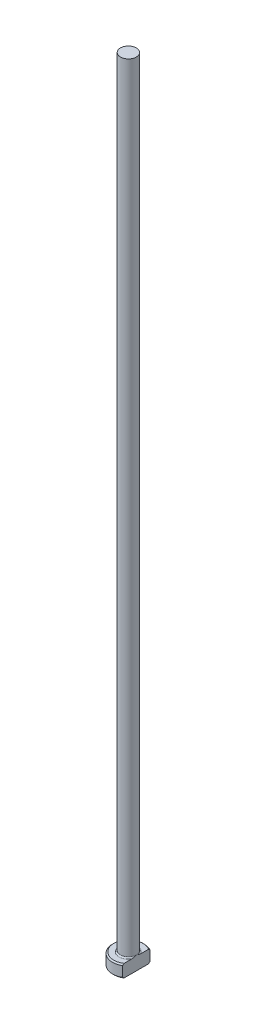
ISO-10303-21;
HEADER;
FILE_DESCRIPTION(('STEP AP214'),'2;1');
FILE_NAME('part.step','',(''),(''),'','','');
FILE_SCHEMA(('AUTOMOTIVE_DESIGN { 1 0 10303 214 1 1 1 1 }'));
ENDSEC;
DATA;
#1=APPLICATION_CONTEXT('core data for automotive mechanical design processes');
#2=APPLICATION_PROTOCOL_DEFINITION('international standard','automotive_design',2000,#1);
#3=PRODUCT_CONTEXT('',#1,'mechanical');
#4=PRODUCT('Part','Part','',(#3));
#5=PRODUCT_RELATED_PRODUCT_CATEGORY('part','',(#4));
#6=PRODUCT_DEFINITION_FORMATION('','',#4);
#7=PRODUCT_DEFINITION_CONTEXT('part definition',#1,'design');
#8=PRODUCT_DEFINITION('design','',#6,#7);
#9=PRODUCT_DEFINITION_SHAPE('','',#8);
#10=(LENGTH_UNIT() NAMED_UNIT(*) SI_UNIT(.MILLI.,.METRE.));
#11=(NAMED_UNIT(*) PLANE_ANGLE_UNIT() SI_UNIT($,.RADIAN.));
#12=(NAMED_UNIT(*) SI_UNIT($,.STERADIAN.) SOLID_ANGLE_UNIT());
#13=UNCERTAINTY_MEASURE_WITH_UNIT(LENGTH_MEASURE(1.E-05),#10,'distance_accuracy_value','');
#14=(GEOMETRIC_REPRESENTATION_CONTEXT(3) GLOBAL_UNCERTAINTY_ASSIGNED_CONTEXT((#13)) GLOBAL_UNIT_ASSIGNED_CONTEXT((#10,
#11,#12)) REPRESENTATION_CONTEXT('',''));
#15=CARTESIAN_POINT('',(0.,0.,0.));
#16=DIRECTION('',(0.,0.,1.));
#17=DIRECTION('',(1.,0.,0.));
#18=AXIS2_PLACEMENT_3D('',#15,#16,#17);
#19=CARTESIAN_POINT('',(0.,0.,0.));
#20=DIRECTION('',(0.,-1.,0.));
#21=DIRECTION('',(0.,0.,-1.));
#22=AXIS2_PLACEMENT_3D('',#19,#20,#21);
#23=PLANE('',#22);
#24=CARTESIAN_POINT('',(0.,0.,0.));
#25=DIRECTION('',(0.,-1.,0.));
#26=DIRECTION('',(0.,0.,-1.));
#27=AXIS2_PLACEMENT_3D('',#24,#25,#26);
#28=CIRCLE('',#27,2.29999999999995);
#29=CARTESIAN_POINT('',(1.24999999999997,0.,1.93067345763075));
#30=VERTEX_POINT('',#29);
#31=CARTESIAN_POINT('',(1.24999999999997,0.,-1.93067345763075));
#32=VERTEX_POINT('',#31);
#33=EDGE_CURVE('E98',#30,#32,#28,.T.);
#34=ORIENTED_EDGE('',*,*,#33,.T.);
#35=DIRECTION('',(0.,0.,1.));
#36=VECTOR('',#35,1.);
#37=CARTESIAN_POINT('',(1.24999999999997,0.,-2.16506350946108));
#38=LINE('',#37,#36);
#39=EDGE_CURVE('E83',#32,#30,#38,.T.);
#40=ORIENTED_EDGE('',*,*,#39,.T.);
#41=EDGE_LOOP('',(#34,#40));
#42=FACE_BOUND('',#41,.T.);
#43=ADVANCED_FACE('F32',(#42),#23,.T.);
#44=CARTESIAN_POINT('',(0.,259.958771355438,0.));
#45=DIRECTION('',(0.,1.,0.));
#46=DIRECTION('',(0.,0.,1.));
#47=AXIS2_PLACEMENT_3D('',#44,#45,#46);
#48=CYLINDRICAL_SURFACE('',#47,2.49999999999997);
#49=CARTESIAN_POINT('',(0.,1.79999999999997,0.));
#50=DIRECTION('',(0.,1.,0.));
#51=DIRECTION('',(0.,0.,1.));
#52=AXIS2_PLACEMENT_3D('',#49,#50,#51);
#53=CIRCLE('',#52,2.49999999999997);
#54=CARTESIAN_POINT('',(1.24999999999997,1.79999999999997,2.16506350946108));
#55=VERTEX_POINT('',#54);
#56=CARTESIAN_POINT('',(1.24999999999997,1.79999999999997,-2.16506350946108));
#57=VERTEX_POINT('',#56);
#58=EDGE_CURVE('E104',#55,#57,#53,.F.);
#59=ORIENTED_EDGE('',*,*,#58,.T.);
#60=DIRECTION('',(0.,-1.,0.));
#61=VECTOR('',#60,1.);
#62=CARTESIAN_POINT('',(1.24999999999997,125.,-2.16506350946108));
#63=LINE('',#62,#61);
#64=CARTESIAN_POINT('',(1.24999999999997,0.200000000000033,-2.16506350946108));
#65=VERTEX_POINT('',#64);
#66=EDGE_CURVE('E183',#57,#65,#63,.T.);
#67=ORIENTED_EDGE('',*,*,#66,.T.);
#68=CARTESIAN_POINT('',(0.,0.200000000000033,0.));
#69=DIRECTION('',(0.,-1.,0.));
#70=DIRECTION('',(0.,0.,-1.));
#71=AXIS2_PLACEMENT_3D('',#68,#69,#70);
#72=CIRCLE('',#71,2.49999999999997);
#73=CARTESIAN_POINT('',(1.24999999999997,0.200000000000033,2.16506350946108));
#74=VERTEX_POINT('',#73);
#75=EDGE_CURVE('E100',#65,#74,#72,.F.);
#76=ORIENTED_EDGE('',*,*,#75,.T.);
#77=DIRECTION('',(0.,-1.,0.));
#78=VECTOR('',#77,1.);
#79=CARTESIAN_POINT('',(1.24999999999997,125.,2.16506350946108));
#80=LINE('',#79,#78);
#81=EDGE_CURVE('E93',#55,#74,#80,.T.);
#82=ORIENTED_EDGE('',*,*,#81,.F.);
#83=EDGE_LOOP('',(#59,#67,#76,#82));
#84=FACE_BOUND('',#83,.T.);
#85=ADVANCED_FACE('F158',(#84),#48,.T.);
#86=CARTESIAN_POINT('',(-2.49999999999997,2.,0.));
#87=DIRECTION('',(0.,1.,0.));
#88=DIRECTION('',(0.,0.,1.));
#89=AXIS2_PLACEMENT_3D('',#86,#87,#88);
#90=PLANE('',#89);
#91=CARTESIAN_POINT('',(0.,2.,0.));
#92=DIRECTION('',(0.,1.,0.));
#93=DIRECTION('',(0.,0.,1.));
#94=AXIS2_PLACEMENT_3D('',#91,#92,#93);
#95=CIRCLE('',#94,2.29999999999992);
#96=CARTESIAN_POINT('',(1.24999999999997,2.,-1.9306734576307));
#97=VERTEX_POINT('',#96);
#98=CARTESIAN_POINT('',(1.24999999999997,2.,1.9306734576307));
#99=VERTEX_POINT('',#98);
#100=EDGE_CURVE('E178',#97,#99,#95,.T.);
#101=ORIENTED_EDGE('',*,*,#100,.T.);
#102=DIRECTION('',(0.,0.,-1.));
#103=VECTOR('',#102,1.);
#104=CARTESIAN_POINT('',(1.24999999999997,2.,0.));
#105=LINE('',#104,#103);
#106=CARTESIAN_POINT('',(1.24999999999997,1.99999999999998,0.73484692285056));
#107=VERTEX_POINT('',#106);
#108=EDGE_CURVE('E57',#99,#107,#105,.T.);
#109=ORIENTED_EDGE('',*,*,#108,.T.);
#110=CARTESIAN_POINT('',(0.,2.,0.));
#111=DIRECTION('',(0.,1.,0.));
#112=DIRECTION('',(0.,0.,1.));
#113=AXIS2_PLACEMENT_3D('',#110,#111,#112);
#114=CIRCLE('',#113,1.44999999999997);
#115=CARTESIAN_POINT('',(1.24999999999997,1.99999999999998,-0.734846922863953));
#116=VERTEX_POINT('',#115);
#117=EDGE_CURVE('E107',#107,#116,#114,.F.);
#118=ORIENTED_EDGE('',*,*,#117,.T.);
#119=EDGE_CURVE('E136',#116,#97,#105,.T.);
#120=ORIENTED_EDGE('',*,*,#119,.T.);
#121=EDGE_LOOP('',(#101,#109,#118,#120));
#122=FACE_BOUND('',#121,.T.);
#123=ADVANCED_FACE('F147',(#122),#90,.T.);
#124=CARTESIAN_POINT('',(0.,2.,0.));
#125=DIRECTION('',(0.,-1.,0.));
#126=DIRECTION('',(0.,0.,-1.));
#127=AXIS2_PLACEMENT_3D('',#124,#125,#126);
#128=CONICAL_SURFACE('',#127,2.29999999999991,0.785398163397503);
#129=ORIENTED_EDGE('',*,*,#58,.F.);
#130=CARTESIAN_POINT('',(1.24999999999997,-0.627301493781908,4.76610952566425));
#131=CARTESIAN_POINT('',(1.24999999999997,-0.522786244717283,4.65805337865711));
#132=CARTESIAN_POINT('',(1.24999999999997,-0.418383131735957,4.54988840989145));
#133=CARTESIAN_POINT('',(1.24999999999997,-0.209867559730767,4.33327605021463));
#134=CARTESIAN_POINT('',(1.24999999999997,-0.105755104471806,4.22482865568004));
#135=CARTESIAN_POINT('',(1.24999999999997,0.102163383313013,4.0075337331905));
#136=CARTESIAN_POINT('',(1.24999999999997,0.205969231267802,3.89868602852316));
#137=CARTESIAN_POINT('',(1.24999999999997,0.413121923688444,3.68055575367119));
#138=CARTESIAN_POINT('',(1.24999999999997,0.516468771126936,3.57127318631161));
#139=CARTESIAN_POINT('',(1.24999999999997,0.720522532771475,3.35432408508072));
#140=CARTESIAN_POINT('',(1.24999999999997,0.821241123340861,3.24666854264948));
#141=CARTESIAN_POINT('',(1.24999999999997,1.02192410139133,3.03065701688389));
#142=CARTESIAN_POINT('',(1.24999999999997,1.12188849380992,2.92230103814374));
#143=CARTESIAN_POINT('',(1.24999999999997,1.32077037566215,2.70467415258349));
#144=CARTESIAN_POINT('',(1.24999999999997,1.41968808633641,2.59540344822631));
#145=CARTESIAN_POINT('',(1.24999999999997,1.61608273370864,2.37557697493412));
#146=CARTESIAN_POINT('',(1.24999999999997,1.71355972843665,2.26502125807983));
#147=CARTESIAN_POINT('',(1.24999999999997,1.86911393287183,2.08515617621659));
#148=CARTESIAN_POINT('',(1.24999999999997,1.92785594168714,2.01642247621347));
#149=CARTESIAN_POINT('',(1.24999999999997,2.04429378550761,1.87806056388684));
#150=CARTESIAN_POINT('',(1.24999999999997,2.10198951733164,1.80843226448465));
#151=CARTESIAN_POINT('',(1.24999999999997,2.21658041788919,1.66728976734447));
#152=CARTESIAN_POINT('',(1.24999999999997,2.27346067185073,1.59576341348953));
#153=CARTESIAN_POINT('',(1.24999999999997,2.38522965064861,1.45118948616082));
#154=CARTESIAN_POINT('',(1.24999999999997,2.44011885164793,1.37814228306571));
#155=CARTESIAN_POINT('',(1.24999999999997,2.547887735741,1.22886697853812));
#156=CARTESIAN_POINT('',(1.24999999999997,2.60072420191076,1.1526074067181));
#157=CARTESIAN_POINT('',(1.24999999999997,2.70212030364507,0.997098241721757));
#158=CARTESIAN_POINT('',(1.24999999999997,2.75067405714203,0.917844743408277));
#159=CARTESIAN_POINT('',(1.24999999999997,2.84043729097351,0.756494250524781));
#160=CARTESIAN_POINT('',(1.24999999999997,2.88173033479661,0.674444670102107));
#161=CARTESIAN_POINT('',(1.24999999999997,2.95366083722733,0.50583597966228));
#162=CARTESIAN_POINT('',(1.24999999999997,2.98433405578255,0.419293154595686));
#163=CARTESIAN_POINT('',(1.24999999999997,3.01753107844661,0.28950787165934));
#164=CARTESIAN_POINT('',(1.24999999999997,3.0263353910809,0.247870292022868));
#165=CARTESIAN_POINT('',(1.24999999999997,3.03997448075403,0.163937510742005));
#166=CARTESIAN_POINT('',(1.24999999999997,3.04480960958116,0.121642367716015));
#167=CARTESIAN_POINT('',(1.24999999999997,3.05016786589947,0.0369068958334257));
#168=CARTESIAN_POINT('',(1.24999999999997,3.05070431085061,-0.00553257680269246));
#169=CARTESIAN_POINT('',(1.24999999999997,3.04746162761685,-0.0902467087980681));
#170=CARTESIAN_POINT('',(1.24999999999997,3.04368214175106,-0.132521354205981));
#171=CARTESIAN_POINT('',(1.24999999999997,3.03212264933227,-0.216135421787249));
#172=CARTESIAN_POINT('',(1.24999999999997,3.02437758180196,-0.257479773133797));
#173=CARTESIAN_POINT('',(1.24999999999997,3.00536735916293,-0.339354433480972));
#174=CARTESIAN_POINT('',(1.24999999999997,2.99410082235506,-0.379884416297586));
#175=CARTESIAN_POINT('',(1.24999999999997,2.96852211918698,-0.460209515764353));
#176=CARTESIAN_POINT('',(1.24999999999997,2.95419322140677,-0.499999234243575));
#177=CARTESIAN_POINT('',(1.24999999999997,2.92306392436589,-0.578577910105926));
#178=CARTESIAN_POINT('',(1.24999999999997,2.90626403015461,-0.617367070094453));
#179=CARTESIAN_POINT('',(1.24999999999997,2.85269034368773,-0.73271994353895));
#180=CARTESIAN_POINT('',(1.24999999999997,2.81287978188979,-0.807869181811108));
#181=CARTESIAN_POINT('',(1.24999999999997,2.72799210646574,-0.955157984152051));
#182=CARTESIAN_POINT('',(1.24999999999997,2.68290855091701,-1.02729371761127));
#183=CARTESIAN_POINT('',(1.24999999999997,2.58903993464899,-1.16950551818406));
#184=CARTESIAN_POINT('',(1.24999999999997,2.54024093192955,-1.2395723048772));
#185=CARTESIAN_POINT('',(1.24999999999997,2.44021824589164,-1.37788366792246));
#186=CARTESIAN_POINT('',(1.24999999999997,2.38899576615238,-1.44612912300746));
#187=CARTESIAN_POINT('',(1.24999999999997,2.28411092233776,-1.58215279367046));
#188=CARTESIAN_POINT('',(1.24999999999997,2.2304252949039,-1.64991298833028));
#189=CARTESIAN_POINT('',(1.24999999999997,2.12172412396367,-1.78436052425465));
#190=CARTESIAN_POINT('',(1.24999999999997,2.06670849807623,-1.85104779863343));
#191=CARTESIAN_POINT('',(1.24999999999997,1.90044437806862,-2.04954410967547));
#192=CARTESIAN_POINT('',(1.24999999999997,1.78772044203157,-2.18011527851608));
#193=CARTESIAN_POINT('',(1.24999999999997,1.57927088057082,-2.41711311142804));
#194=CARTESIAN_POINT('',(1.24999999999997,1.48391557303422,-2.52386864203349));
#195=CARTESIAN_POINT('',(1.24999999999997,1.29202937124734,-2.73632311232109));
#196=CARTESIAN_POINT('',(1.24999999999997,1.19549844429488,-2.84202202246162));
#197=CARTESIAN_POINT('',(1.24999999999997,0.904469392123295,-3.15815976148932));
#198=CARTESIAN_POINT('',(1.24999999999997,0.708713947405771,-3.36743889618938));
#199=CARTESIAN_POINT('',(1.24999999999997,0.323382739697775,-3.77561196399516));
#200=CARTESIAN_POINT('',(1.24999999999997,0.133884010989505,-3.97457897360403));
#201=CARTESIAN_POINT('',(1.24999999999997,-0.151120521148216,-4.27209258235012));
#202=CARTESIAN_POINT('',(1.24999999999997,-0.246194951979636,-4.37105278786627));
#203=CARTESIAN_POINT('',(1.24999999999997,-0.436581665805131,-4.56874260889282));
#204=CARTESIAN_POINT('',(1.24999999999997,-0.531893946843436,-4.66747222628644));
#205=CARTESIAN_POINT('',(1.24999999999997,-0.627301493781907,-4.76610952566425));
#206=B_SPLINE_CURVE_WITH_KNOTS('',3,(#130,#131,#132,#133,#134,#135,#136,#137,#138,#139,#140,
#141,#142,#143,#144,#145,#146,#147,#148,#149,#150,#151,#152,#153,#154,#155,#156,#157,#158,#159,
#160,#161,#162,#163,#164,#165,#166,#167,#168,#169,#170,#171,#172,#173,#174,#175,#176,#177,#178,
#179,#180,#181,#182,#183,#184,#185,#186,#187,#188,#189,#190,#191,#192,#193,#194,#195,#196,#197,
#198,#199,#200,#201,#202,#203,#204,#205),.UNSPECIFIED.,.F.,.F.,(4,2,2,2,2,2,2,2,2,2,2,2,2,2,2,2,
2,2,2,2,2,2,2,2,2,2,2,2,2,2,2,2,2,2,2,2,2,4),(0.,0.450994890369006,0.901995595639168,
1.35322763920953,1.80445675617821,2.24672733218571,2.68899501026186,3.13116725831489,
3.5733216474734,3.84456018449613,4.11582532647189,4.38995864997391,4.66402597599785,
4.94225842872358,5.22086725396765,5.49602313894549,5.77024327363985,5.8977564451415,
6.0252583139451,6.15236502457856,6.2794822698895,6.40549833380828,6.5315639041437,
6.65833670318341,6.78508362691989,7.03983854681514,7.29490801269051,7.55098686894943,
7.80693985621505,8.06626716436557,8.32561057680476,8.84304654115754,9.2724624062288,
9.70189024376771,10.5615524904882,11.3858525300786,11.797544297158,12.2092326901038),.UNSPECIFIED.);
#207=EDGE_CURVE('E135',#55,#99,#206,.T.);
#208=ORIENTED_EDGE('',*,*,#207,.T.);
#209=ORIENTED_EDGE('',*,*,#100,.F.);
#210=EDGE_CURVE('E127',#97,#57,#206,.T.);
#211=ORIENTED_EDGE('',*,*,#210,.T.);
#212=EDGE_LOOP('',(#129,#208,#209,#211));
#213=FACE_BOUND('',#212,.T.);
#214=ADVANCED_FACE('F143',(#213),#128,.T.);
#215=CARTESIAN_POINT('',(0.,0.200000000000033,0.));
#216=DIRECTION('',(0.,1.,0.));
#217=DIRECTION('',(0.,0.,1.));
#218=AXIS2_PLACEMENT_3D('',#215,#216,#217);
#219=CONICAL_SURFACE('',#218,2.49999999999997,0.785398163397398);
#220=ORIENTED_EDGE('',*,*,#75,.F.);
#221=CARTESIAN_POINT('',(1.24999999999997,2.62730149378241,-4.76610952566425));
#222=CARTESIAN_POINT('',(1.24999999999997,2.52278624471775,-4.6580533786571));
#223=CARTESIAN_POINT('',(1.24999999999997,2.41838313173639,-4.54988840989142));
#224=CARTESIAN_POINT('',(1.24999999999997,2.20986755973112,-4.33327605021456));
#225=CARTESIAN_POINT('',(1.24999999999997,2.10575510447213,-4.22482865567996));
#226=CARTESIAN_POINT('',(1.24999999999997,1.89783661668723,-4.00753373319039));
#227=CARTESIAN_POINT('',(1.24999999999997,1.79403076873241,-3.89868602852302));
#228=CARTESIAN_POINT('',(1.24999999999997,1.58687807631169,-3.68055575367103));
#229=CARTESIAN_POINT('',(1.24999999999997,1.48353122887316,-3.57127318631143));
#230=CARTESIAN_POINT('',(1.24999999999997,1.27947746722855,-3.35432408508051));
#231=CARTESIAN_POINT('',(1.24999999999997,1.17875887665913,-3.24666854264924));
#232=CARTESIAN_POINT('',(1.24999999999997,0.978075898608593,-3.03065701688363));
#233=CARTESIAN_POINT('',(1.24999999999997,0.878111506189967,-2.92230103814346));
#234=CARTESIAN_POINT('',(1.24999999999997,0.679229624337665,-2.70467415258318));
#235=CARTESIAN_POINT('',(1.24999999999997,0.580311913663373,-2.59540344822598));
#236=CARTESIAN_POINT('',(1.24999999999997,0.383917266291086,-2.37557697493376));
#237=CARTESIAN_POINT('',(1.24999999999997,0.286440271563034,-2.26502125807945));
#238=CARTESIAN_POINT('',(1.24999999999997,0.130886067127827,-2.08515617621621));
#239=CARTESIAN_POINT('',(1.24999999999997,0.0721440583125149,-2.0164224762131));
#240=CARTESIAN_POINT('',(1.24999999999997,-0.0442937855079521,-1.87806056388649));
#241=CARTESIAN_POINT('',(1.24999999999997,-0.101989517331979,-1.80843226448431));
#242=CARTESIAN_POINT('',(1.24999999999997,-0.216580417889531,-1.66728976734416));
#243=CARTESIAN_POINT('',(1.24999999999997,-0.273460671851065,-1.59576341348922));
#244=CARTESIAN_POINT('',(1.24999999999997,-0.385229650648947,-1.45118948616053));
#245=CARTESIAN_POINT('',(1.24999999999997,-0.440118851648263,-1.37814228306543));
#246=CARTESIAN_POINT('',(1.24999999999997,-0.547887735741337,-1.22886697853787));
#247=CARTESIAN_POINT('',(1.24999999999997,-0.600724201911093,-1.15260740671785));
#248=CARTESIAN_POINT('',(1.24999999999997,-0.702120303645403,-0.997098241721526));
#249=CARTESIAN_POINT('',(1.24999999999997,-0.75067405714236,-0.917844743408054));
#250=CARTESIAN_POINT('',(1.24999999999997,-0.840437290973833,-0.756494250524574));
#251=CARTESIAN_POINT('',(1.24999999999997,-0.881730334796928,-0.674444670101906));
#252=CARTESIAN_POINT('',(1.24999999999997,-0.953660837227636,-0.505835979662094));
#253=CARTESIAN_POINT('',(1.24999999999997,-0.984334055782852,-0.419293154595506));
#254=CARTESIAN_POINT('',(1.24999999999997,-1.0175310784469,-0.289507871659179));
#255=CARTESIAN_POINT('',(1.24999999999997,-1.02633539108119,-0.247870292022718));
#256=CARTESIAN_POINT('',(1.24999999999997,-1.0399744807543,-0.163937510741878));
#257=CARTESIAN_POINT('',(1.24999999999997,-1.04480960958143,-0.121642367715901));
#258=CARTESIAN_POINT('',(1.24999999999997,-1.05016786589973,-0.0369068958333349));
#259=CARTESIAN_POINT('',(1.24999999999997,-1.05070431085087,0.00553257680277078));
#260=CARTESIAN_POINT('',(1.24999999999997,-1.0474616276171,0.0902467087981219));
#261=CARTESIAN_POINT('',(1.24999999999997,-1.04368214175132,0.132521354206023));
#262=CARTESIAN_POINT('',(1.24999999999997,-1.03212264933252,0.216135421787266));
#263=CARTESIAN_POINT('',(1.24999999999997,-1.02437758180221,0.257479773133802));
#264=CARTESIAN_POINT('',(1.24999999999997,-1.00536735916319,0.339354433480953));
#265=CARTESIAN_POINT('',(1.24999999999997,-0.994100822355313,0.379884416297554));
#266=CARTESIAN_POINT('',(1.24999999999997,-0.96852211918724,0.460209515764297));
#267=CARTESIAN_POINT('',(1.24999999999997,-0.954193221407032,0.499999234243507));
#268=CARTESIAN_POINT('',(1.24999999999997,-0.923063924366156,0.578577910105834));
#269=CARTESIAN_POINT('',(1.24999999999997,-0.906264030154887,0.61736707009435));
#270=CARTESIAN_POINT('',(1.24999999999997,-0.852690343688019,0.732719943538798));
#271=CARTESIAN_POINT('',(1.24999999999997,-0.8128797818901,0.807869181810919));
#272=CARTESIAN_POINT('',(1.24999999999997,-0.727992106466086,0.955157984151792));
#273=CARTESIAN_POINT('',(1.24999999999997,-0.682908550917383,1.02729371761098));
#274=CARTESIAN_POINT('',(1.24999999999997,-0.5890399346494,1.1695055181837));
#275=CARTESIAN_POINT('',(1.24999999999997,-0.540240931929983,1.2395723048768));
#276=CARTESIAN_POINT('',(1.24999999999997,-0.440218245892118,1.37788366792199));
#277=CARTESIAN_POINT('',(1.24999999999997,-0.388995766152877,1.44612912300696));
#278=CARTESIAN_POINT('',(1.24999999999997,-0.284110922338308,1.5821527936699));
#279=CARTESIAN_POINT('',(1.24999999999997,-0.230425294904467,1.64991298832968));
#280=CARTESIAN_POINT('',(1.24999999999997,-0.121724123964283,1.78436052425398));
#281=CARTESIAN_POINT('',(1.24999999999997,-0.0667084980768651,1.85104779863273));
#282=CARTESIAN_POINT('',(1.24999999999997,0.0995556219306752,2.04954410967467));
#283=CARTESIAN_POINT('',(1.24999999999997,0.212279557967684,2.18011527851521));
#284=CARTESIAN_POINT('',(1.24999999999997,0.420729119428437,2.41711311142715));
#285=CARTESIAN_POINT('',(1.24999999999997,0.516084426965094,2.52386864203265));
#286=CARTESIAN_POINT('',(1.24999999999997,0.707970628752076,2.73632311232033));
#287=CARTESIAN_POINT('',(1.24999999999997,0.804501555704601,2.84202202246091));
#288=CARTESIAN_POINT('',(1.24999999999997,1.09553060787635,3.15815976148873));
#289=CARTESIAN_POINT('',(1.24999999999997,1.29128605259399,3.36743889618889));
#290=CARTESIAN_POINT('',(1.24999999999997,1.67661726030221,3.77561196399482));
#291=CARTESIAN_POINT('',(1.24999999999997,1.86611598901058,3.97457897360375));
#292=CARTESIAN_POINT('',(1.24999999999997,2.15112052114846,4.27209258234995));
#293=CARTESIAN_POINT('',(1.24999999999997,2.24619495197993,4.37105278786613));
#294=CARTESIAN_POINT('',(1.24999999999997,2.43658166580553,4.56874260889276));
#295=CARTESIAN_POINT('',(1.24999999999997,2.53189394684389,4.66747222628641));
#296=CARTESIAN_POINT('',(1.24999999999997,2.62730149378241,4.76610952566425));
#297=B_SPLINE_CURVE_WITH_KNOTS('',3,(#221,#222,#223,#224,#225,#226,#227,#228,#229,#230,#231,
#232,#233,#234,#235,#236,#237,#238,#239,#240,#241,#242,#243,#244,#245,#246,#247,#248,#249,#250,
#251,#252,#253,#254,#255,#256,#257,#258,#259,#260,#261,#262,#263,#264,#265,#266,#267,#268,#269,
#270,#271,#272,#273,#274,#275,#276,#277,#278,#279,#280,#281,#282,#283,#284,#285,#286,#287,#288,
#289,#290,#291,#292,#293,#294,#295,#296),.UNSPECIFIED.,.F.,.F.,(4,2,2,2,2,2,2,2,2,2,2,2,2,2,2,2,
2,2,2,2,2,2,2,2,2,2,2,2,2,2,2,2,2,2,2,2,2,4),(0.,0.45099489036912,0.901995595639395,
1.35322763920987,1.80445675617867,2.24672733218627,2.68899501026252,3.13116725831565,
3.57332164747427,3.84456018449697,4.11582532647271,4.38995864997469,4.66402597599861,
4.94225842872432,5.22086725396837,5.49602313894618,5.77024327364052,5.89775644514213,
6.02525831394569,6.15236502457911,6.27948226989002,6.40549833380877,6.53156390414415,
6.65833670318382,6.78508362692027,7.03983854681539,7.29490801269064,7.55098686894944,
7.80693985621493,8.06626716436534,8.3256105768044,8.84304654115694,9.27246240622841,
9.70189024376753,10.5615524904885,11.3858525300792,11.7975442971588,12.2092326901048),.UNSPECIFIED.);
#298=EDGE_CURVE('E86',#65,#32,#297,.T.);
#299=ORIENTED_EDGE('',*,*,#298,.T.);
#300=ORIENTED_EDGE('',*,*,#33,.F.);
#301=EDGE_CURVE('E89',#30,#74,#297,.T.);
#302=ORIENTED_EDGE('',*,*,#301,.T.);
#303=EDGE_LOOP('',(#220,#299,#300,#302));
#304=FACE_BOUND('',#303,.T.);
#305=ADVANCED_FACE('F97',(#304),#219,.T.);
#306=CARTESIAN_POINT('',(0.,2.19999999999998,0.));
#307=DIRECTION('',(0.,1.,0.));
#308=DIRECTION('',(0.,0.,1.));
#309=AXIS2_PLACEMENT_3D('',#306,#307,#308);
#310=TOROIDAL_SURFACE('',#309,1.44999999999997,0.2);
#311=CARTESIAN_POINT('',(1.24999999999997,2.19999999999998,0.));
#312=CARTESIAN_POINT('',(1.24999999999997,2.20000051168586,-1.9767961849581E-10));
#313=CARTESIAN_POINT('',(1.24999999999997,2.20000102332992,-1.08908063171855E-07));
#314=CARTESIAN_POINT('',(1.24999999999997,2.20000200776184,-4.52594759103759E-07));
#315=CARTESIAN_POINT('',(1.24999999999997,2.20000247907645,-6.90993033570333E-07));
#316=CARTESIAN_POINT('',(1.24999999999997,2.20000341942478,-1.26357942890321E-06));
#317=CARTESIAN_POINT('',(1.24999999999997,2.20000388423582,-1.60457617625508E-06));
#318=CARTESIAN_POINT('',(1.24999999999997,2.20000476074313,-2.3395489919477E-06));
#319=CARTESIAN_POINT('',(1.24999999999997,2.20000517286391,-2.7330414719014E-06));
#320=CARTESIAN_POINT('',(1.24999999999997,2.20000655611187,-4.14544010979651E-06));
#321=CARTESIAN_POINT('',(1.24999999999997,2.20000745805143,-5.23310089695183E-06));
#322=CARTESIAN_POINT('',(1.24999999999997,2.20000906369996,-7.47950358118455E-06));
#323=CARTESIAN_POINT('',(1.24999999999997,2.20000977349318,-8.63414435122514E-06));
#324=CARTESIAN_POINT('',(1.24999999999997,2.20001244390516,-1.31453476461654E-05));
#325=CARTESIAN_POINT('',(1.24999999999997,2.20001426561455,-1.65880555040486E-05));
#326=CARTESIAN_POINT('',(1.24999999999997,2.20001724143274,-2.33729028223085E-05));
#327=CARTESIAN_POINT('',(1.24999999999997,2.20001844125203,-2.66956153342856E-05));
#328=CARTESIAN_POINT('',(1.24999999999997,2.2000235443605,-4.08635084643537E-05));
#329=CARTESIAN_POINT('',(1.24999999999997,2.20002741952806,-5.17114612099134E-05));
#330=CARTESIAN_POINT('',(1.24999999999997,2.20003363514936,-7.20057670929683E-05));
#331=CARTESIAN_POINT('',(1.24999999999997,2.20003612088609,-8.14057063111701E-05));
#332=CARTESIAN_POINT('',(1.24999999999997,2.20005581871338,-0.000149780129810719));
#333=CARTESIAN_POINT('',(1.24999999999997,2.20008094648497,-0.000206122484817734));
#334=CARTESIAN_POINT('',(1.24999999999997,2.20017507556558,-0.000425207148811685));
#335=CARTESIAN_POINT('',(1.24999999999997,2.20023819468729,-0.000589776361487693));
#336=CARTESIAN_POINT('',(1.24999999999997,2.20048692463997,-0.00122878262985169));
#337=CARTESIAN_POINT('',(1.24999999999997,2.20067870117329,-0.00170134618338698));
#338=CARTESIAN_POINT('',(1.24999999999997,2.20146022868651,-0.00363636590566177));
#339=CARTESIAN_POINT('',(1.24999999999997,2.20204298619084,-0.00510090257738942));
#340=CARTESIAN_POINT('',(1.24999999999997,2.20939719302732,-0.0235712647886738));
#341=CARTESIAN_POINT('',(1.24999999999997,2.21621259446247,-0.0405643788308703));
#342=CARTESIAN_POINT('',(1.24999999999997,2.22951000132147,-0.0739606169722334));
#343=CARTESIAN_POINT('',(1.24999999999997,2.23599508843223,-0.0903626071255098));
#344=CARTESIAN_POINT('',(1.24999999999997,2.24961430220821,-0.12511129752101));
#345=CARTESIAN_POINT('',(1.24999999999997,2.25673641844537,-0.143462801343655));
#346=CARTESIAN_POINT('',(1.24999999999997,2.27085039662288,-0.180427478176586));
#347=CARTESIAN_POINT('',(1.24999999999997,2.27784022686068,-0.199041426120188));
#348=CARTESIAN_POINT('',(1.24999999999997,2.29479134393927,-0.245221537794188));
#349=CARTESIAN_POINT('',(1.24999999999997,2.30459026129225,-0.272848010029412));
#350=CARTESIAN_POINT('',(1.24999999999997,2.32310234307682,-0.327738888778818));
#351=CARTESIAN_POINT('',(1.24999999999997,2.33183568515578,-0.354996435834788));
#352=CARTESIAN_POINT('',(1.24999999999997,2.3493656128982,-0.41374417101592));
#353=CARTESIAN_POINT('',(1.24999999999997,2.35799470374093,-0.445285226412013));
#354=CARTESIAN_POINT('',(1.24999999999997,2.37338463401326,-0.509091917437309));
#355=CARTESIAN_POINT('',(1.24999999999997,2.38013036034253,-0.541361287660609));
#356=CARTESIAN_POINT('',(1.24999999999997,2.39136059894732,-0.608339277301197));
#357=CARTESIAN_POINT('',(1.24999999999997,2.39568167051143,-0.643076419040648));
#358=CARTESIAN_POINT('',(1.24999999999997,2.40037605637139,-0.712733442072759));
#359=CARTESIAN_POINT('',(1.24999999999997,2.40076553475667,-0.747651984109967));
#360=CARTESIAN_POINT('',(1.24999999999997,2.39677668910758,-0.8081037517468));
#361=CARTESIAN_POINT('',(1.24999999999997,2.39361441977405,-0.833711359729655));
#362=CARTESIAN_POINT('',(1.24999999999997,2.38355990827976,-0.883915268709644));
#363=CARTESIAN_POINT('',(1.24999999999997,2.37671813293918,-0.908520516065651));
#364=CARTESIAN_POINT('',(1.24999999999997,2.36252570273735,-0.944879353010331));
#365=CARTESIAN_POINT('',(1.24999999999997,2.35688428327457,-0.957298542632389));
#366=CARTESIAN_POINT('',(1.24999999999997,2.34399066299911,-0.981318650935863));
#367=CARTESIAN_POINT('',(1.24999999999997,2.33673636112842,-0.992918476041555));
#368=CARTESIAN_POINT('',(1.24999999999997,2.32199744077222,-1.01267533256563));
#369=CARTESIAN_POINT('',(1.24999999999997,2.31482723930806,-1.02106482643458));
#370=CARTESIAN_POINT('',(1.24999999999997,2.29924321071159,-1.03659690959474));
#371=CARTESIAN_POINT('',(1.24999999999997,2.29083198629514,-1.04374204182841));
#372=CARTESIAN_POINT('',(1.24999999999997,2.27498600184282,-1.05478694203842));
#373=CARTESIAN_POINT('',(1.24999999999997,2.26780814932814,-1.05905359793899));
#374=CARTESIAN_POINT('',(1.24999999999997,2.25284782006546,-1.06635953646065));
#375=CARTESIAN_POINT('',(1.24999999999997,2.24506572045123,-1.06939957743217));
#376=CARTESIAN_POINT('',(1.24999999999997,2.22901828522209,-1.07404931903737));
#377=CARTESIAN_POINT('',(1.24999999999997,2.22074990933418,-1.07564870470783));
#378=CARTESIAN_POINT('',(1.24999999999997,2.20405985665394,-1.07723717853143));
#379=CARTESIAN_POINT('',(1.24999999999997,2.19563825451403,-1.07722703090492));
#380=CARTESIAN_POINT('',(1.24999999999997,2.17988128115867,-1.07569157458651));
#381=CARTESIAN_POINT('',(1.24999999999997,2.17252879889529,-1.0743339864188));
#382=CARTESIAN_POINT('',(1.24999999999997,2.15814333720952,-1.07044616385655));
#383=CARTESIAN_POINT('',(1.24999999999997,2.15111040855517,-1.06791574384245));
#384=CARTESIAN_POINT('',(1.24999999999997,2.13724955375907,-1.06171920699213));
#385=CARTESIAN_POINT('',(1.24999999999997,2.13043935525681,-1.05801386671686));
#386=CARTESIAN_POINT('',(1.24999999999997,2.11740316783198,-1.04969609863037));
#387=CARTESIAN_POINT('',(1.24999999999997,2.11117742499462,-1.04508329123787));
#388=CARTESIAN_POINT('',(1.24999999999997,2.09586196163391,-1.03220341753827));
#389=CARTESIAN_POINT('',(1.24999999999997,2.08723799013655,-1.02338140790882));
#390=CARTESIAN_POINT('',(1.24999999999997,2.07148817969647,-1.00448021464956));
#391=CARTESIAN_POINT('',(1.24999999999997,2.0643671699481,-0.994397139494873));
#392=CARTESIAN_POINT('',(1.24999999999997,2.04800089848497,-0.967694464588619));
#393=CARTESIAN_POINT('',(1.24999999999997,2.0397014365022,-0.950498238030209));
#394=CARTESIAN_POINT('',(1.24999999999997,2.02582422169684,-0.915117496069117));
#395=CARTESIAN_POINT('',(1.24999999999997,2.02024415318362,-0.896933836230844));
#396=CARTESIAN_POINT('',(1.24999999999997,2.00805724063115,-0.846781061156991));
#397=CARTESIAN_POINT('',(1.24999999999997,2.00359525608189,-0.8142976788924));
#398=CARTESIAN_POINT('',(1.24999999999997,1.99933348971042,-0.748574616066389));
#399=CARTESIAN_POINT('',(1.24999999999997,1.99961552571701,-0.715331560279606));
#400=CARTESIAN_POINT('',(1.24999999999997,2.00446632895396,-0.637920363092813));
#401=CARTESIAN_POINT('',(1.24999999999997,2.01044886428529,-0.593849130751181));
#402=CARTESIAN_POINT('',(1.24999999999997,2.02681929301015,-0.506401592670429));
#403=CARTESIAN_POINT('',(1.24999999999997,2.03722697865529,-0.463029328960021));
#404=CARTESIAN_POINT('',(1.24999999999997,2.06007158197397,-0.380638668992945));
#405=CARTESIAN_POINT('',(1.24999999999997,2.07227412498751,-0.34155342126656));
#406=CARTESIAN_POINT('',(1.24999999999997,2.09824323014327,-0.264347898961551));
#407=CARTESIAN_POINT('',(1.24999999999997,2.11199311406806,-0.226221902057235));
#408=CARTESIAN_POINT('',(1.24999999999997,2.13108825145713,-0.175350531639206));
#409=CARTESIAN_POINT('',(1.24999999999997,2.13599999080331,-0.16243890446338));
#410=CARTESIAN_POINT('',(1.24999999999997,2.14604281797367,-0.13631825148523));
#411=CARTESIAN_POINT('',(1.24999999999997,2.15117629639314,-0.123110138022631));
#412=CARTESIAN_POINT('',(1.24999999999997,2.16341702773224,-0.0918425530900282));
#413=CARTESIAN_POINT('',(1.24999999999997,2.17055250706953,-0.0737943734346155));
#414=CARTESIAN_POINT('',(1.24999999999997,2.18426943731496,-0.0393586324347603));
#415=CARTESIAN_POINT('',(1.24999999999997,2.19084281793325,-0.0229681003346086));
#416=CARTESIAN_POINT('',(1.24999999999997,2.19795564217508,-0.00510438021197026));
#417=CARTESIAN_POINT('',(1.24999999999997,2.19853702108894,-0.00364331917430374));
#418=CARTESIAN_POINT('',(1.24999999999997,2.19931818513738,-0.00170914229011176));
#419=CARTESIAN_POINT('',(1.24999999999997,2.19951102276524,-0.00123396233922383));
#420=CARTESIAN_POINT('',(1.24999999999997,2.19976104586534,-0.000591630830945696));
#421=CARTESIAN_POINT('',(1.24999999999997,2.19982443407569,-0.000426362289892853));
#422=CARTESIAN_POINT('',(1.24999999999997,2.1999189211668,-0.000206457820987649));
#423=CARTESIAN_POINT('',(1.24999999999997,2.19994410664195,-0.000149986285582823));
#424=CARTESIAN_POINT('',(1.24999999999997,2.19996383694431,-8.1464748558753E-05));
#425=CARTESIAN_POINT('',(1.24999999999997,2.19996632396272,-7.20551566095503E-05));
#426=CARTESIAN_POINT('',(1.24999999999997,2.19997254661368,-5.17396175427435E-05));
#427=CARTESIAN_POINT('',(1.24999999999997,2.19997642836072,-4.08803462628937E-05));
#428=CARTESIAN_POINT('',(1.24999999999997,2.19998153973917,-2.66997572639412E-05));
#429=CARTESIAN_POINT('',(1.24999999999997,2.1999827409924,-2.33755457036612E-05));
#430=CARTESIAN_POINT('',(1.24999999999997,2.19998572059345,-1.65878757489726E-05));
#431=CARTESIAN_POINT('',(1.24999999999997,2.19998754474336,-1.31438993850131E-05));
#432=CARTESIAN_POINT('',(1.24999999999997,2.19999021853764,-8.63150510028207E-06));
#433=CARTESIAN_POINT('',(1.24999999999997,2.19999092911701,-7.47674879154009E-06));
#434=CARTESIAN_POINT('',(1.24999999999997,2.19999253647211,-5.23027079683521E-06));
#435=CARTESIAN_POINT('',(1.24999999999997,2.19999343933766,-4.14265820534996E-06));
#436=CARTESIAN_POINT('',(1.24999999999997,2.19999482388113,-2.73051190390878E-06));
#437=CARTESIAN_POINT('',(1.24999999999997,2.19999523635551,-2.33712918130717E-06));
#438=CARTESIAN_POINT('',(1.24999999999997,2.19999611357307,-1.60243917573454E-06));
#439=CARTESIAN_POINT('',(1.24999999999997,2.19999657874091,-1.26161620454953E-06));
#440=CARTESIAN_POINT('',(1.24999999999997,2.19999751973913,-6.89449591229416E-07));
#441=CARTESIAN_POINT('',(1.24999999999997,2.19999799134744,-4.51288697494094E-07));
#442=CARTESIAN_POINT('',(1.24999999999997,2.19999897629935,-1.08178109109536E-07));
#443=CARTESIAN_POINT('',(1.24999999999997,2.19999948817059,1.97735059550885E-10));
#444=CARTESIAN_POINT('',(1.24999999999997,2.19999999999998,0.));
#445=B_SPLINE_CURVE_WITH_KNOTS('',3,(#311,#312,#313,#314,#315,#316,#317,#318,#319,#320,#321,
#322,#323,#324,#325,#326,#327,#328,#329,#330,#331,#332,#333,#334,#335,#336,#337,#338,#339,#340,
#341,#342,#343,#344,#345,#346,#347,#348,#349,#350,#351,#352,#353,#354,#355,#356,#357,#358,#359,
#360,#361,#362,#363,#364,#365,#366,#367,#368,#369,#370,#371,#372,#373,#374,#375,#376,#377,#378,
#379,#380,#381,#382,#383,#384,#385,#386,#387,#388,#389,#390,#391,#392,#393,#394,#395,#396,#397,
#398,#399,#400,#401,#402,#403,#404,#405,#406,#407,#408,#409,#410,#411,#412,#413,#414,#415,#416,
#417,#418,#419,#420,#421,#422,#423,#424,#425,#426,#427,#428,#429,#430,#431,#432,#433,#434,#435,
#436,#437,#438,#439,#440,#441,#442,#443,#444),.UNSPECIFIED.,.T.,.F.,(4,2,2,2,2,2,2,2,2,2,2,2,2,
2,2,2,2,2,2,2,2,2,2,2,2,2,2,2,2,2,2,2,2,2,2,2,2,2,2,2,2,2,2,2,2,2,2,2,2,2,2,2,2,2,2,2,2,2,2,2,2,
2,2,2,2,2,4),(0.,1.53427576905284E-06,3.11115061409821E-06,4.83351643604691E-06,
6.54098955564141E-06,1.07594295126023E-05,1.48222852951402E-05,2.64707315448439E-05,
3.70576290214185E-05,7.16088727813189E-05,0.000100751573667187,0.000285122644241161,
0.000814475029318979,0.00234373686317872,0.00707317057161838,0.061994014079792,
0.114907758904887,0.173961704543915,0.233609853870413,0.321537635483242,0.407388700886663,
0.505443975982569,0.604264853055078,0.709126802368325,0.813557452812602,0.890773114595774,
0.966955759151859,1.00778845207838,1.04867465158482,1.08167318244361,1.1146034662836,
1.13955805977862,1.16449720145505,1.18961351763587,1.21471790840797,1.23704542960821,
1.25937648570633,1.28254952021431,1.30573226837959,1.34253218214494,1.37944859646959,
1.43640829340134,1.4933194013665,1.59113685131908,1.69064301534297,1.82371118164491,
1.9573808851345,2.08016146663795,2.20172662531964,2.24316968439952,2.28568093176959,
2.34390494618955,2.39687801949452,2.40159623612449,2.40313396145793,2.40366556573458,
2.40385035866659,2.40387953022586,2.40391411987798,2.40392471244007,2.40393636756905,
2.4039404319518,2.40394465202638,2.40394636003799,2.4039480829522,2.40394966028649,
2.40395119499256),.UNSPECIFIED.);
#446=CARTESIAN_POINT('',(1.24999999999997,2.19999999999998,0.));
#447=VERTEX_POINT('',#446);
#448=EDGE_CURVE('E11',#116,#447,#445,.T.);
#449=ORIENTED_EDGE('',*,*,#448,.F.);
#450=ORIENTED_EDGE('',*,*,#117,.F.);
#451=CARTESIAN_POINT('',(1.24999999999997,2.19999999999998,0.));
#452=CARTESIAN_POINT('',(1.24999999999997,2.1999994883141,1.97679627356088E-10));
#453=CARTESIAN_POINT('',(1.24999999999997,2.19999897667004,1.08908063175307E-07));
#454=CARTESIAN_POINT('',(1.24999999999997,2.19999799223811,4.52594759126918E-07));
#455=CARTESIAN_POINT('',(1.24999999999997,2.19999752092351,6.90993033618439E-07));
#456=CARTESIAN_POINT('',(1.24999999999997,2.19999658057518,1.26357942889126E-06));
#457=CARTESIAN_POINT('',(1.24999999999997,2.19999611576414,1.60457617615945E-06));
#458=CARTESIAN_POINT('',(1.24999999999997,2.19999523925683,2.33954899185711E-06));
#459=CARTESIAN_POINT('',(1.24999999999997,2.19999482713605,2.73304147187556E-06));
#460=CARTESIAN_POINT('',(1.24999999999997,2.19999344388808,4.14544010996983E-06));
#461=CARTESIAN_POINT('',(1.24999999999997,2.19999254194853,5.23310089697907E-06));
#462=CARTESIAN_POINT('',(1.24999999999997,2.1999909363,7.47950358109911E-06));
#463=CARTESIAN_POINT('',(1.24999999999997,2.19999022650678,8.63414435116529E-06));
#464=CARTESIAN_POINT('',(1.24999999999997,2.1999875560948,1.3145347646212E-05));
#465=CARTESIAN_POINT('',(1.24999999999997,2.19998573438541,1.65880555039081E-05));
#466=CARTESIAN_POINT('',(1.24999999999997,2.19998275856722,2.33729028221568E-05));
#467=CARTESIAN_POINT('',(1.24999999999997,2.19998155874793,2.66956153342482E-05));
#468=CARTESIAN_POINT('',(1.24999999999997,2.19997645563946,4.08635084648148E-05));
#469=CARTESIAN_POINT('',(1.24999999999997,2.1999725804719,5.1711461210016E-05));
#470=CARTESIAN_POINT('',(1.24999999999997,2.1999663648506,7.2005767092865E-05));
#471=CARTESIAN_POINT('',(1.24999999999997,2.19996387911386,8.14057063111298E-05));
#472=CARTESIAN_POINT('',(1.24999999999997,2.19994418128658,0.000149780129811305));
#473=CARTESIAN_POINT('',(1.24999999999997,2.19991905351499,0.000206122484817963));
#474=CARTESIAN_POINT('',(1.24999999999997,2.19982492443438,0.000425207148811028));
#475=CARTESIAN_POINT('',(1.24999999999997,2.19976180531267,0.000589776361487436));
#476=CARTESIAN_POINT('',(1.24999999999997,2.19951307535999,0.00122878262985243));
#477=CARTESIAN_POINT('',(1.24999999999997,2.19932129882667,0.00170134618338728));
#478=CARTESIAN_POINT('',(1.24999999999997,2.19853977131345,0.00363636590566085));
#479=CARTESIAN_POINT('',(1.24999999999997,2.19795701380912,0.00510090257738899));
#480=CARTESIAN_POINT('',(1.24999999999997,2.19060280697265,0.0235712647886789));
#481=CARTESIAN_POINT('',(1.24999999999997,2.18378740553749,0.0405643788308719));
#482=CARTESIAN_POINT('',(1.24999999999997,2.17048999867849,0.0739606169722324));
#483=CARTESIAN_POINT('',(1.24999999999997,2.16400491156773,0.0903626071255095));
#484=CARTESIAN_POINT('',(1.24999999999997,2.15038569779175,0.125111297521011));
#485=CARTESIAN_POINT('',(1.24999999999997,2.14326358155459,0.143462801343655));
#486=CARTESIAN_POINT('',(1.24999999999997,2.12914960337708,0.180427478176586));
#487=CARTESIAN_POINT('',(1.24999999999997,2.12215977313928,0.199041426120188));
#488=CARTESIAN_POINT('',(1.24999999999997,2.10520865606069,0.245221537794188));
#489=CARTESIAN_POINT('',(1.24999999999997,2.09540973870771,0.272848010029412));
#490=CARTESIAN_POINT('',(1.24999999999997,2.07689765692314,0.327738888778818));
#491=CARTESIAN_POINT('',(1.24999999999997,2.06816431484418,0.354996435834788));
#492=CARTESIAN_POINT('',(1.24999999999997,2.05063438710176,0.41374417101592));
#493=CARTESIAN_POINT('',(1.24999999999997,2.04200529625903,0.445285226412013));
#494=CARTESIAN_POINT('',(1.24999999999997,2.0266153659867,0.509091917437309));
#495=CARTESIAN_POINT('',(1.24999999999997,2.01986963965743,0.541361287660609));
#496=CARTESIAN_POINT('',(1.24999999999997,2.00863940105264,0.608339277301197));
#497=CARTESIAN_POINT('',(1.24999999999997,2.00431832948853,0.643076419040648));
#498=CARTESIAN_POINT('',(1.24999999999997,1.99962394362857,0.712733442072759));
#499=CARTESIAN_POINT('',(1.24999999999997,1.99923446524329,0.747651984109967));
#500=CARTESIAN_POINT('',(1.24999999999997,2.00322331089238,0.8081037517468));
#501=CARTESIAN_POINT('',(1.24999999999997,2.00638558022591,0.833711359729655));
#502=CARTESIAN_POINT('',(1.24999999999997,2.0164400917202,0.883915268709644));
#503=CARTESIAN_POINT('',(1.24999999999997,2.02328186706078,0.908520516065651));
#504=CARTESIAN_POINT('',(1.24999999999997,2.03747429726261,0.944879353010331));
#505=CARTESIAN_POINT('',(1.24999999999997,2.04311571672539,0.957298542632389));
#506=CARTESIAN_POINT('',(1.24999999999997,2.05600933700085,0.981318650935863));
#507=CARTESIAN_POINT('',(1.24999999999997,2.06326363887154,0.992918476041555));
#508=CARTESIAN_POINT('',(1.24999999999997,2.07800255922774,1.01267533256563));
#509=CARTESIAN_POINT('',(1.24999999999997,2.0851727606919,1.02106482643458));
#510=CARTESIAN_POINT('',(1.24999999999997,2.10075678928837,1.03659690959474));
#511=CARTESIAN_POINT('',(1.24999999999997,2.10916801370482,1.04374204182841));
#512=CARTESIAN_POINT('',(1.24999999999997,2.12501399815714,1.05478694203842));
#513=CARTESIAN_POINT('',(1.24999999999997,2.13219185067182,1.05905359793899));
#514=CARTESIAN_POINT('',(1.24999999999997,2.1471521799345,1.06635953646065));
#515=CARTESIAN_POINT('',(1.24999999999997,2.15493427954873,1.06939957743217));
#516=CARTESIAN_POINT('',(1.24999999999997,2.17098171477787,1.07404931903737));
#517=CARTESIAN_POINT('',(1.24999999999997,2.17925009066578,1.07564870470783));
#518=CARTESIAN_POINT('',(1.24999999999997,2.19594014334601,1.07723717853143));
#519=CARTESIAN_POINT('',(1.24999999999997,2.20436174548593,1.07722703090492));
#520=CARTESIAN_POINT('',(1.24999999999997,2.22011871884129,1.07569157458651));
#521=CARTESIAN_POINT('',(1.24999999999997,2.22747120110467,1.0743339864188));
#522=CARTESIAN_POINT('',(1.24999999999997,2.24185666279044,1.07044616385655));
#523=CARTESIAN_POINT('',(1.24999999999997,2.24888959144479,1.06791574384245));
#524=CARTESIAN_POINT('',(1.24999999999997,2.26275044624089,1.06171920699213));
#525=CARTESIAN_POINT('',(1.24999999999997,2.26956064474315,1.05801386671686));
#526=CARTESIAN_POINT('',(1.24999999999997,2.28259683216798,1.04969609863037));
#527=CARTESIAN_POINT('',(1.24999999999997,2.28882257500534,1.04508329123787));
#528=CARTESIAN_POINT('',(1.24999999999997,2.30413803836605,1.03220341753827));
#529=CARTESIAN_POINT('',(1.24999999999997,2.31276200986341,1.02338140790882));
#530=CARTESIAN_POINT('',(1.24999999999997,2.32851182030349,1.00448021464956));
#531=CARTESIAN_POINT('',(1.24999999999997,2.33563283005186,0.994397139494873));
#532=CARTESIAN_POINT('',(1.24999999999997,2.35199910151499,0.967694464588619));
#533=CARTESIAN_POINT('',(1.24999999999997,2.36029856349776,0.950498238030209));
#534=CARTESIAN_POINT('',(1.24999999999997,2.37417577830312,0.915117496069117));
#535=CARTESIAN_POINT('',(1.24999999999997,2.37975584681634,0.896933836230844));
#536=CARTESIAN_POINT('',(1.24999999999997,2.3919427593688,0.846781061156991));
#537=CARTESIAN_POINT('',(1.24999999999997,2.39640474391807,0.8142976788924));
#538=CARTESIAN_POINT('',(1.24999999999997,2.40066651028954,0.748574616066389));
#539=CARTESIAN_POINT('',(1.24999999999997,2.40038447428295,0.715331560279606));
#540=CARTESIAN_POINT('',(1.24999999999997,2.395533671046,0.637920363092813));
#541=CARTESIAN_POINT('',(1.24999999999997,2.38955113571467,0.593849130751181));
#542=CARTESIAN_POINT('',(1.24999999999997,2.3731807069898,0.506401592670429));
#543=CARTESIAN_POINT('',(1.24999999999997,2.36277302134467,0.463029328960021));
#544=CARTESIAN_POINT('',(1.24999999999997,2.33992841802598,0.380638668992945));
#545=CARTESIAN_POINT('',(1.24999999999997,2.32772587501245,0.34155342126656));
#546=CARTESIAN_POINT('',(1.24999999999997,2.30175676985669,0.264347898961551));
#547=CARTESIAN_POINT('',(1.24999999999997,2.2880068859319,0.226221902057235));
#548=CARTESIAN_POINT('',(1.24999999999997,2.26891174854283,0.175350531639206));
#549=CARTESIAN_POINT('',(1.24999999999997,2.26400000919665,0.162438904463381));
#550=CARTESIAN_POINT('',(1.24999999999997,2.25395718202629,0.13631825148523));
#551=CARTESIAN_POINT('',(1.24999999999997,2.24882370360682,0.123110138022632));
#552=CARTESIAN_POINT('',(1.24999999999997,2.23658297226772,0.091842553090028));
#553=CARTESIAN_POINT('',(1.24999999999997,2.22944749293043,0.0737943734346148));
#554=CARTESIAN_POINT('',(1.24999999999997,2.215730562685,0.0393586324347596));
#555=CARTESIAN_POINT('',(1.24999999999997,2.20915718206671,0.0229681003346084));
#556=CARTESIAN_POINT('',(1.24999999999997,2.20204435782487,0.00510438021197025));
#557=CARTESIAN_POINT('',(1.24999999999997,2.20146297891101,0.00364331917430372));
#558=CARTESIAN_POINT('',(1.24999999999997,2.20068181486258,0.00170914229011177));
#559=CARTESIAN_POINT('',(1.24999999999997,2.20048897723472,0.00123396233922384));
#560=CARTESIAN_POINT('',(1.24999999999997,2.20023895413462,0.000591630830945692));
#561=CARTESIAN_POINT('',(1.24999999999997,2.20017556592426,0.000426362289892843));
#562=CARTESIAN_POINT('',(1.24999999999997,2.20008107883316,0.000206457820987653));
#563=CARTESIAN_POINT('',(1.24999999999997,2.20005589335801,0.000149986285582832));
#564=CARTESIAN_POINT('',(1.24999999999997,2.20003616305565,8.14647485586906E-05));
#565=CARTESIAN_POINT('',(1.24999999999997,2.20003367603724,7.20551566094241E-05));
#566=CARTESIAN_POINT('',(1.24999999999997,2.20002745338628,5.17396175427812E-05));
#567=CARTESIAN_POINT('',(1.24999999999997,2.20002357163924,4.08803462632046E-05));
#568=CARTESIAN_POINT('',(1.24999999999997,2.20001846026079,2.66997572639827E-05));
#569=CARTESIAN_POINT('',(1.24999999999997,2.20001725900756,2.33755457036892E-05));
#570=CARTESIAN_POINT('',(1.24999999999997,2.20001427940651,1.65878757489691E-05));
#571=CARTESIAN_POINT('',(1.24999999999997,2.2000124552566,1.31438993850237E-05));
#572=CARTESIAN_POINT('',(1.24999999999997,2.20000978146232,8.63150510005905E-06));
#573=CARTESIAN_POINT('',(1.24999999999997,2.20000907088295,7.47674879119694E-06));
#574=CARTESIAN_POINT('',(1.24999999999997,2.20000746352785,5.23027079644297E-06));
#575=CARTESIAN_POINT('',(1.24999999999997,2.2000065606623,4.14265820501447E-06));
#576=CARTESIAN_POINT('',(1.24999999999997,2.20000517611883,2.7305119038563E-06));
#577=CARTESIAN_POINT('',(1.24999999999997,2.20000476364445,2.33712918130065E-06));
#578=CARTESIAN_POINT('',(1.24999999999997,2.20000388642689,1.60243917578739E-06));
#579=CARTESIAN_POINT('',(1.24999999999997,2.20000342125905,1.26161620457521E-06));
#580=CARTESIAN_POINT('',(1.24999999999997,2.20000248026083,6.89449591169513E-07));
#581=CARTESIAN_POINT('',(1.24999999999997,2.20000200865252,4.51288697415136E-07));
#582=CARTESIAN_POINT('',(1.24999999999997,2.20000102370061,1.0817810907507E-07));
#583=CARTESIAN_POINT('',(1.24999999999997,2.20000051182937,-1.97735068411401E-10));
#584=CARTESIAN_POINT('',(1.24999999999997,2.19999999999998,0.));
#585=B_SPLINE_CURVE_WITH_KNOTS('',3,(#451,#452,#453,#454,#455,#456,#457,#458,#459,#460,#461,
#462,#463,#464,#465,#466,#467,#468,#469,#470,#471,#472,#473,#474,#475,#476,#477,#478,#479,#480,
#481,#482,#483,#484,#485,#486,#487,#488,#489,#490,#491,#492,#493,#494,#495,#496,#497,#498,#499,
#500,#501,#502,#503,#504,#505,#506,#507,#508,#509,#510,#511,#512,#513,#514,#515,#516,#517,#518,
#519,#520,#521,#522,#523,#524,#525,#526,#527,#528,#529,#530,#531,#532,#533,#534,#535,#536,#537,
#538,#539,#540,#541,#542,#543,#544,#545,#546,#547,#548,#549,#550,#551,#552,#553,#554,#555,#556,
#557,#558,#559,#560,#561,#562,#563,#564,#565,#566,#567,#568,#569,#570,#571,#572,#573,#574,#575,
#576,#577,#578,#579,#580,#581,#582,#583,#584),.UNSPECIFIED.,.T.,.F.,(4,2,2,2,2,2,2,2,2,2,2,2,2,
2,2,2,2,2,2,2,2,2,2,2,2,2,2,2,2,2,2,2,2,2,2,2,2,2,2,2,2,2,2,2,2,2,2,2,2,2,2,2,2,2,2,2,2,2,2,2,2,
2,2,2,2,2,4),(0.,1.53427576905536E-06,3.11115061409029E-06,4.83351643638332E-06,
6.54098955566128E-06,1.07594295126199E-05,1.48222852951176E-05,2.64707315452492E-05,
3.7057629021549E-05,7.16088727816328E-05,0.000100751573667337,0.000285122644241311,
0.00081447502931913,0.00234373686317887,0.00707317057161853,0.0619940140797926,
0.114907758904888,0.173961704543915,0.233609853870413,0.321537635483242,0.407388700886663,
0.50544397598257,0.604264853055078,0.709126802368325,0.813557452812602,0.890773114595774,
0.966955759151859,1.00778845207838,1.04867465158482,1.08167318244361,1.1146034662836,
1.13955805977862,1.16449720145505,1.18961351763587,1.21471790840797,1.23704542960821,
1.25937648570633,1.28254952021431,1.30573226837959,1.34253218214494,1.37944859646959,
1.43640829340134,1.4933194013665,1.59113685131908,1.69064301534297,1.82371118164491,
1.9573808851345,2.08016146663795,2.20172662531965,2.24316968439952,2.28568093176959,
2.34390494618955,2.39687801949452,2.40159623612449,2.40313396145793,2.40366556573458,
2.40385035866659,2.40387953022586,2.40391411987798,2.40392471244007,2.40393636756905,
2.40394043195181,2.40394465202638,2.40394636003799,2.4039480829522,2.40394966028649,
2.40395119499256),.UNSPECIFIED.);
#586=EDGE_CURVE('E46',#447,#107,#585,.T.);
#587=ORIENTED_EDGE('',*,*,#586,.F.);
#588=CARTESIAN_POINT('',(0.,2.19999999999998,0.));
#589=DIRECTION('',(0.,1.,0.));
#590=DIRECTION('',(0.,0.,1.));
#591=AXIS2_PLACEMENT_3D('',#588,#589,#590);
#592=CIRCLE('',#591,1.24999999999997);
#593=EDGE_CURVE('E103',#447,#447,#592,.T.);
#594=ORIENTED_EDGE('',*,*,#593,.F.);
#595=EDGE_LOOP('',(#449,#450,#587,#594));
#596=FACE_BOUND('',#595,.T.);
#597=ADVANCED_FACE('F34',(#596),#310,.F.);
#598=CARTESIAN_POINT('',(0.,259.958771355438,0.));
#599=DIRECTION('',(0.,1.,0.));
#600=DIRECTION('',(0.,0.,1.));
#601=AXIS2_PLACEMENT_3D('',#598,#599,#600);
#602=CYLINDRICAL_SURFACE('',#601,1.24999999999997);
#603=ORIENTED_EDGE('',*,*,#593,.T.);
#604=EDGE_LOOP('',(#603));
#605=FACE_BOUND('',#604,.T.);
#606=CARTESIAN_POINT('',(0.,125.,0.));
#607=DIRECTION('',(0.,1.,0.));
#608=DIRECTION('',(0.,0.,1.));
#609=AXIS2_PLACEMENT_3D('',#606,#607,#608);
#610=CIRCLE('',#609,1.24999999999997);
#611=CARTESIAN_POINT('',(0.,125.,1.24999999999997));
#612=VERTEX_POINT('',#611);
#613=EDGE_CURVE('E101',#612,#612,#610,.T.);
#614=ORIENTED_EDGE('',*,*,#613,.F.);
#615=EDGE_LOOP('',(#614));
#616=FACE_BOUND('',#615,.T.);
#617=ADVANCED_FACE('F155',(#605,#616),#602,.T.);
#618=CARTESIAN_POINT('',(-1.24999999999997,125.,0.));
#619=DIRECTION('',(0.,1.,0.));
#620=DIRECTION('',(0.,0.,1.));
#621=AXIS2_PLACEMENT_3D('',#618,#619,#620);
#622=PLANE('',#621);
#623=ORIENTED_EDGE('',*,*,#613,.T.);
#624=EDGE_LOOP('',(#623));
#625=FACE_BOUND('',#624,.T.);
#626=ADVANCED_FACE('F121',(#625),#622,.T.);
#627=CARTESIAN_POINT('',(1.24999999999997,125.,-2.16506350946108));
#628=DIRECTION('',(1.,0.,0.));
#629=DIRECTION('',(0.,0.,-1.));
#630=AXIS2_PLACEMENT_3D('',#627,#628,#629);
#631=PLANE('',#630);
#632=ORIENTED_EDGE('',*,*,#66,.F.);
#633=ORIENTED_EDGE('',*,*,#210,.F.);
#634=ORIENTED_EDGE('',*,*,#119,.F.);
#635=ORIENTED_EDGE('',*,*,#448,.T.);
#636=ORIENTED_EDGE('',*,*,#586,.T.);
#637=ORIENTED_EDGE('',*,*,#108,.F.);
#638=ORIENTED_EDGE('',*,*,#207,.F.);
#639=ORIENTED_EDGE('',*,*,#81,.T.);
#640=ORIENTED_EDGE('',*,*,#301,.F.);
#641=ORIENTED_EDGE('',*,*,#39,.F.);
#642=ORIENTED_EDGE('',*,*,#298,.F.);
#643=EDGE_LOOP('',(#632,#633,#634,#635,#636,#637,#638,#639,#640,#641,#642));
#644=FACE_BOUND('',#643,.T.);
#645=ADVANCED_FACE('F85',(#644),#631,.T.);
#646=CLOSED_SHELL('',(#43,#85,#123,#214,#305,#597,#617,#626,#645));
#647=MANIFOLD_SOLID_BREP('B2',#646);
#648=ADVANCED_BREP_SHAPE_REPRESENTATION('',(#18,#647),#14);
#649=SHAPE_DEFINITION_REPRESENTATION(#9,#648);
ENDSEC;
END-ISO-10303-21;
